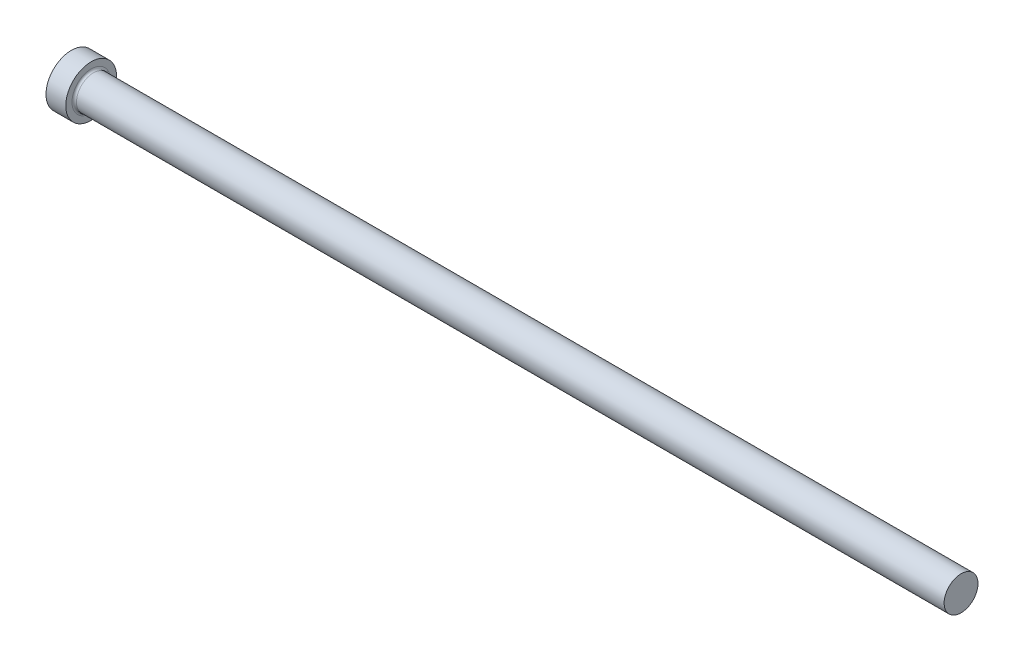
ISO-10303-21;
HEADER;
FILE_DESCRIPTION(('STEP AP214'),'2;1');
FILE_NAME('part.step','',(''),(''),'','','');
FILE_SCHEMA(('AUTOMOTIVE_DESIGN { 1 0 10303 214 1 1 1 1 }'));
ENDSEC;
DATA;
#1=APPLICATION_CONTEXT('core data for automotive mechanical design processes');
#2=APPLICATION_PROTOCOL_DEFINITION('international standard','automotive_design',2000,#1);
#3=PRODUCT_CONTEXT('',#1,'mechanical');
#4=PRODUCT('Part','Part','',(#3));
#5=PRODUCT_RELATED_PRODUCT_CATEGORY('part','',(#4));
#6=PRODUCT_DEFINITION_FORMATION('','',#4);
#7=PRODUCT_DEFINITION_CONTEXT('part definition',#1,'design');
#8=PRODUCT_DEFINITION('design','',#6,#7);
#9=PRODUCT_DEFINITION_SHAPE('','',#8);
#10=(LENGTH_UNIT() NAMED_UNIT(*) SI_UNIT(.MILLI.,.METRE.));
#11=(NAMED_UNIT(*) PLANE_ANGLE_UNIT() SI_UNIT($,.RADIAN.));
#12=(NAMED_UNIT(*) SI_UNIT($,.STERADIAN.) SOLID_ANGLE_UNIT());
#13=UNCERTAINTY_MEASURE_WITH_UNIT(LENGTH_MEASURE(1.E-05),#10,'distance_accuracy_value','');
#14=(GEOMETRIC_REPRESENTATION_CONTEXT(3) GLOBAL_UNCERTAINTY_ASSIGNED_CONTEXT((#13)) GLOBAL_UNIT_ASSIGNED_CONTEXT((#10,
#11,#12)) REPRESENTATION_CONTEXT('',''));
#15=CARTESIAN_POINT('',(0.,0.,0.));
#16=DIRECTION('',(0.,0.,1.));
#17=DIRECTION('',(1.,0.,0.));
#18=AXIS2_PLACEMENT_3D('',#15,#16,#17);
#19=CARTESIAN_POINT('',(0.,0.,0.));
#20=DIRECTION('',(-1.,0.,0.));
#21=DIRECTION('',(0.,-1.,0.));
#22=AXIS2_PLACEMENT_3D('',#19,#20,#21);
#23=PLANE('',#22);
#24=CARTESIAN_POINT('',(0.,0.,0.));
#25=DIRECTION('',(1.,0.,0.));
#26=DIRECTION('',(0.,1.,0.));
#27=AXIS2_PLACEMENT_3D('',#24,#25,#26);
#28=CIRCLE('',#27,9.);
#29=CARTESIAN_POINT('',(0.,9.,0.));
#30=VERTEX_POINT('',#29);
#31=EDGE_CURVE('E25',#30,#30,#28,.T.);
#32=ORIENTED_EDGE('',*,*,#31,.F.);
#33=EDGE_LOOP('',(#32));
#34=FACE_BOUND('',#33,.T.);
#35=ADVANCED_FACE('F14',(#34),#23,.T.);
#36=CARTESIAN_POINT('',(315.,0.,0.));
#37=DIRECTION('',(1.,0.,0.));
#38=DIRECTION('',(0.,1.,0.));
#39=AXIS2_PLACEMENT_3D('',#36,#37,#38);
#40=CYLINDRICAL_SURFACE('',#39,9.);
#41=ORIENTED_EDGE('',*,*,#31,.T.);
#42=EDGE_LOOP('',(#41));
#43=FACE_BOUND('',#42,.T.);
#44=CARTESIAN_POINT('',(7.,0.,0.));
#45=DIRECTION('',(1.,0.,0.));
#46=DIRECTION('',(0.,1.,0.));
#47=AXIS2_PLACEMENT_3D('',#44,#45,#46);
#48=CIRCLE('',#47,9.);
#49=CARTESIAN_POINT('',(7.,9.,0.));
#50=VERTEX_POINT('',#49);
#51=EDGE_CURVE('E29',#50,#50,#48,.T.);
#52=ORIENTED_EDGE('',*,*,#51,.F.);
#53=EDGE_LOOP('',(#52));
#54=FACE_BOUND('',#53,.T.);
#55=ADVANCED_FACE('F51',(#43,#54),#40,.T.);
#56=CARTESIAN_POINT('',(7.,9.,0.));
#57=DIRECTION('',(1.,0.,0.));
#58=DIRECTION('',(0.,1.,0.));
#59=AXIS2_PLACEMENT_3D('',#56,#57,#58);
#60=PLANE('',#59);
#61=CARTESIAN_POINT('',(7.,0.,0.));
#62=DIRECTION('',(1.,0.,0.));
#63=DIRECTION('',(0.,1.,0.));
#64=AXIS2_PLACEMENT_3D('',#61,#62,#63);
#65=CIRCLE('',#64,6.8);
#66=CARTESIAN_POINT('',(7.,6.8,0.));
#67=VERTEX_POINT('',#66);
#68=EDGE_CURVE('E9',#67,#67,#65,.F.);
#69=ORIENTED_EDGE('',*,*,#68,.T.);
#70=EDGE_LOOP('',(#69));
#71=FACE_BOUND('',#70,.T.);
#72=ORIENTED_EDGE('',*,*,#51,.T.);
#73=EDGE_LOOP('',(#72));
#74=FACE_BOUND('',#73,.T.);
#75=ADVANCED_FACE('F42',(#71,#74),#60,.T.);
#76=CARTESIAN_POINT('',(315.,0.,0.));
#77=DIRECTION('',(1.,0.,0.));
#78=DIRECTION('',(0.,1.,0.));
#79=AXIS2_PLACEMENT_3D('',#76,#77,#78);
#80=CYLINDRICAL_SURFACE('',#79,6.);
#81=CARTESIAN_POINT('',(7.8,0.,0.));
#82=DIRECTION('',(1.,0.,0.));
#83=DIRECTION('',(0.,1.,0.));
#84=AXIS2_PLACEMENT_3D('',#81,#82,#83);
#85=CIRCLE('',#84,6.);
#86=CARTESIAN_POINT('',(7.8,6.,0.));
#87=VERTEX_POINT('',#86);
#88=EDGE_CURVE('E21',#87,#87,#85,.T.);
#89=ORIENTED_EDGE('',*,*,#88,.T.);
#90=EDGE_LOOP('',(#89));
#91=FACE_BOUND('',#90,.T.);
#92=CARTESIAN_POINT('',(315.,0.,0.));
#93=DIRECTION('',(1.,0.,0.));
#94=DIRECTION('',(0.,1.,0.));
#95=AXIS2_PLACEMENT_3D('',#92,#93,#94);
#96=CIRCLE('',#95,6.);
#97=CARTESIAN_POINT('',(315.,6.00000000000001,0.));
#98=VERTEX_POINT('',#97);
#99=EDGE_CURVE('E34',#98,#98,#96,.T.);
#100=ORIENTED_EDGE('',*,*,#99,.F.);
#101=EDGE_LOOP('',(#100));
#102=FACE_BOUND('',#101,.T.);
#103=ADVANCED_FACE('F40',(#91,#102),#80,.T.);
#104=CARTESIAN_POINT('',(315.,6.,0.));
#105=DIRECTION('',(1.,0.,0.));
#106=DIRECTION('',(0.,1.,0.));
#107=AXIS2_PLACEMENT_3D('',#104,#105,#106);
#108=PLANE('',#107);
#109=ORIENTED_EDGE('',*,*,#99,.T.);
#110=EDGE_LOOP('',(#109));
#111=FACE_BOUND('',#110,.T.);
#112=ADVANCED_FACE('F38',(#111),#108,.T.);
#113=CARTESIAN_POINT('',(7.8,0.,0.));
#114=DIRECTION('',(1.,0.,0.));
#115=DIRECTION('',(0.,1.,0.));
#116=AXIS2_PLACEMENT_3D('',#113,#114,#115);
#117=TOROIDAL_SURFACE('',#116,6.8,0.8);
#118=ORIENTED_EDGE('',*,*,#68,.F.);
#119=EDGE_LOOP('',(#118));
#120=FACE_BOUND('',#119,.T.);
#121=ORIENTED_EDGE('',*,*,#88,.F.);
#122=EDGE_LOOP('',(#121));
#123=FACE_BOUND('',#122,.T.);
#124=ADVANCED_FACE('F16',(#120,#123),#117,.F.);
#125=CLOSED_SHELL('',(#35,#55,#75,#103,#112,#124));
#126=MANIFOLD_SOLID_BREP('B1',#125);
#127=ADVANCED_BREP_SHAPE_REPRESENTATION('',(#18,#126),#14);
#128=SHAPE_DEFINITION_REPRESENTATION(#9,#127);
ENDSEC;
END-ISO-10303-21;
